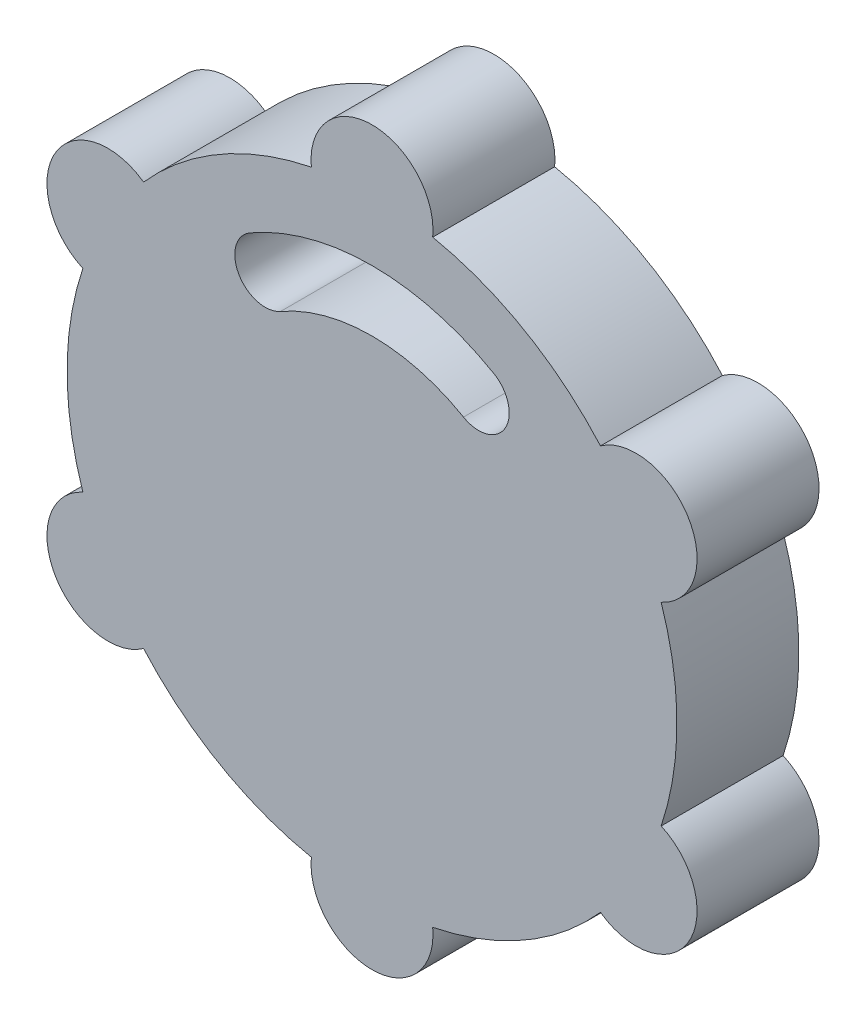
ISO-10303-21;
HEADER;
FILE_DESCRIPTION(('STEP AP214'),'2;1');
FILE_NAME('part.step','',(''),(''),'','','');
FILE_SCHEMA(('AUTOMOTIVE_DESIGN { 1 0 10303 214 1 1 1 1 }'));
ENDSEC;
DATA;
#1=APPLICATION_CONTEXT('core data for automotive mechanical design processes');
#2=APPLICATION_PROTOCOL_DEFINITION('international standard','automotive_design',2000,#1);
#3=PRODUCT_CONTEXT('',#1,'mechanical');
#4=PRODUCT('Part','Part','',(#3));
#5=PRODUCT_RELATED_PRODUCT_CATEGORY('part','',(#4));
#6=PRODUCT_DEFINITION_FORMATION('','',#4);
#7=PRODUCT_DEFINITION_CONTEXT('part definition',#1,'design');
#8=PRODUCT_DEFINITION('design','',#6,#7);
#9=PRODUCT_DEFINITION_SHAPE('','',#8);
#10=(LENGTH_UNIT() NAMED_UNIT(*) SI_UNIT(.MILLI.,.METRE.));
#11=(NAMED_UNIT(*) PLANE_ANGLE_UNIT() SI_UNIT($,.RADIAN.));
#12=(NAMED_UNIT(*) SI_UNIT($,.STERADIAN.) SOLID_ANGLE_UNIT());
#13=UNCERTAINTY_MEASURE_WITH_UNIT(LENGTH_MEASURE(1.E-05),#10,'distance_accuracy_value','');
#14=(GEOMETRIC_REPRESENTATION_CONTEXT(3) GLOBAL_UNCERTAINTY_ASSIGNED_CONTEXT((#13)) GLOBAL_UNIT_ASSIGNED_CONTEXT((#10,
#11,#12)) REPRESENTATION_CONTEXT('',''));
#15=CARTESIAN_POINT('',(0.,0.,0.));
#16=DIRECTION('',(0.,0.,1.));
#17=DIRECTION('',(1.,0.,0.));
#18=AXIS2_PLACEMENT_3D('',#15,#16,#17);
#19=CARTESIAN_POINT('',(43.301270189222,24.9999999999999,20.));
#20=DIRECTION('',(0.,0.,-1.));
#21=DIRECTION('',(-1.,0.,0.));
#22=AXIS2_PLACEMENT_3D('',#19,#20,#21);
#23=CYLINDRICAL_SURFACE('',#22,10.);
#24=CARTESIAN_POINT('',(43.301270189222,24.9999999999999,0.));
#25=DIRECTION('',(0.,0.,1.));
#26=DIRECTION('',(1.,0.,0.));
#27=AXIS2_PLACEMENT_3D('',#24,#25,#26);
#28=CIRCLE('',#27,10.);
#29=CARTESIAN_POINT('',(47.4101819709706,15.8831560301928,0.));
#30=VERTEX_POINT('',#29);
#31=CARTESIAN_POINT('',(37.4603075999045,33.1168439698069,0.));
#32=VERTEX_POINT('',#31);
#33=EDGE_CURVE('E170',#30,#32,#28,.T.);
#34=ORIENTED_EDGE('',*,*,#33,.T.);
#35=DIRECTION('',(0.,0.,-1.));
#36=VECTOR('',#35,1.);
#37=CARTESIAN_POINT('',(37.4603075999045,33.1168439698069,20.));
#38=LINE('',#37,#36);
#39=CARTESIAN_POINT('',(37.4603075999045,33.1168439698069,20.));
#40=VERTEX_POINT('',#39);
#41=EDGE_CURVE('E255',#40,#32,#38,.T.);
#42=ORIENTED_EDGE('',*,*,#41,.F.);
#43=CARTESIAN_POINT('',(43.301270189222,24.9999999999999,20.));
#44=DIRECTION('',(0.,0.,1.));
#45=DIRECTION('',(1.,0.,0.));
#46=AXIS2_PLACEMENT_3D('',#43,#44,#45);
#47=CIRCLE('',#46,10.);
#48=CARTESIAN_POINT('',(47.4101819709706,15.8831560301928,20.));
#49=VERTEX_POINT('',#48);
#50=EDGE_CURVE('E197',#49,#40,#47,.T.);
#51=ORIENTED_EDGE('',*,*,#50,.F.);
#52=DIRECTION('',(0.,0.,-1.));
#53=VECTOR('',#52,1.);
#54=CARTESIAN_POINT('',(47.4101819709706,15.8831560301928,20.));
#55=LINE('',#54,#53);
#56=EDGE_CURVE('E222',#49,#30,#55,.T.);
#57=ORIENTED_EDGE('',*,*,#56,.T.);
#58=EDGE_LOOP('',(#34,#42,#51,#57));
#59=FACE_BOUND('',#58,.T.);
#60=ADVANCED_FACE('F32',(#59),#23,.T.);
#61=CARTESIAN_POINT('',(0.,0.,20.));
#62=DIRECTION('',(0.,0.,-1.));
#63=DIRECTION('',(-1.,0.,0.));
#64=AXIS2_PLACEMENT_3D('',#61,#62,#63);
#65=CYLINDRICAL_SURFACE('',#64,50.);
#66=CARTESIAN_POINT('',(0.,0.,0.));
#67=DIRECTION('',(0.,0.,1.));
#68=DIRECTION('',(1.,0.,0.));
#69=AXIS2_PLACEMENT_3D('',#66,#67,#68);
#70=CIRCLE('',#69,50.);
#71=CARTESIAN_POINT('',(9.94987437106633,49.,0.));
#72=VERTEX_POINT('',#71);
#73=EDGE_CURVE('E175',#32,#72,#70,.T.);
#74=ORIENTED_EDGE('',*,*,#73,.T.);
#75=DIRECTION('',(0.,0.,-1.));
#76=VECTOR('',#75,1.);
#77=CARTESIAN_POINT('',(9.94987437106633,49.,20.));
#78=LINE('',#77,#76);
#79=CARTESIAN_POINT('',(9.94987437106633,49.,20.));
#80=VERTEX_POINT('',#79);
#81=EDGE_CURVE('E252',#80,#72,#78,.T.);
#82=ORIENTED_EDGE('',*,*,#81,.F.);
#83=CARTESIAN_POINT('',(0.,0.,20.));
#84=DIRECTION('',(0.,0.,1.));
#85=DIRECTION('',(1.,0.,0.));
#86=AXIS2_PLACEMENT_3D('',#83,#84,#85);
#87=CIRCLE('',#86,50.);
#88=EDGE_CURVE('E200',#40,#80,#87,.T.);
#89=ORIENTED_EDGE('',*,*,#88,.F.);
#90=ORIENTED_EDGE('',*,*,#41,.T.);
#91=EDGE_LOOP('',(#74,#82,#89,#90));
#92=FACE_BOUND('',#91,.T.);
#93=ADVANCED_FACE('F278',(#92),#65,.T.);
#94=CARTESIAN_POINT('',(1.11022302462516E-13,50.,20.));
#95=DIRECTION('',(0.,0.,-1.));
#96=DIRECTION('',(-1.,0.,0.));
#97=AXIS2_PLACEMENT_3D('',#94,#95,#96);
#98=CYLINDRICAL_SURFACE('',#97,10.);
#99=CARTESIAN_POINT('',(1.11022302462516E-13,50.,0.));
#100=DIRECTION('',(0.,0.,1.));
#101=DIRECTION('',(1.,0.,0.));
#102=AXIS2_PLACEMENT_3D('',#99,#100,#101);
#103=CIRCLE('',#102,10.);
#104=CARTESIAN_POINT('',(-9.9498743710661,49.,0.));
#105=VERTEX_POINT('',#104);
#106=EDGE_CURVE('E177',#72,#105,#103,.T.);
#107=ORIENTED_EDGE('',*,*,#106,.T.);
#108=DIRECTION('',(0.,0.,-1.));
#109=VECTOR('',#108,1.);
#110=CARTESIAN_POINT('',(-9.9498743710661,49.,20.));
#111=LINE('',#110,#109);
#112=CARTESIAN_POINT('',(-9.9498743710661,49.,20.));
#113=VERTEX_POINT('',#112);
#114=EDGE_CURVE('E249',#113,#105,#111,.T.);
#115=ORIENTED_EDGE('',*,*,#114,.F.);
#116=CARTESIAN_POINT('',(1.11022302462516E-13,50.,20.));
#117=DIRECTION('',(0.,0.,1.));
#118=DIRECTION('',(1.,0.,0.));
#119=AXIS2_PLACEMENT_3D('',#116,#117,#118);
#120=CIRCLE('',#119,10.);
#121=EDGE_CURVE('E202',#80,#113,#120,.T.);
#122=ORIENTED_EDGE('',*,*,#121,.F.);
#123=ORIENTED_EDGE('',*,*,#81,.T.);
#124=EDGE_LOOP('',(#107,#115,#122,#123));
#125=FACE_BOUND('',#124,.T.);
#126=ADVANCED_FACE('F283',(#125),#98,.T.);
#127=CARTESIAN_POINT('',(0.,0.,20.));
#128=DIRECTION('',(0.,0.,-1.));
#129=DIRECTION('',(-1.,0.,0.));
#130=AXIS2_PLACEMENT_3D('',#127,#128,#129);
#131=CYLINDRICAL_SURFACE('',#130,50.);
#132=CARTESIAN_POINT('',(0.,0.,0.));
#133=DIRECTION('',(0.,0.,1.));
#134=DIRECTION('',(1.,0.,0.));
#135=AXIS2_PLACEMENT_3D('',#132,#133,#134);
#136=CIRCLE('',#135,50.);
#137=CARTESIAN_POINT('',(-37.4603075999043,33.1168439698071,0.));
#138=VERTEX_POINT('',#137);
#139=EDGE_CURVE('E179',#105,#138,#136,.T.);
#140=ORIENTED_EDGE('',*,*,#139,.T.);
#141=DIRECTION('',(0.,0.,-1.));
#142=VECTOR('',#141,1.);
#143=CARTESIAN_POINT('',(-37.4603075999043,33.1168439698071,20.));
#144=LINE('',#143,#142);
#145=CARTESIAN_POINT('',(-37.4603075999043,33.1168439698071,20.));
#146=VERTEX_POINT('',#145);
#147=EDGE_CURVE('E246',#146,#138,#144,.T.);
#148=ORIENTED_EDGE('',*,*,#147,.F.);
#149=CARTESIAN_POINT('',(0.,0.,20.));
#150=DIRECTION('',(0.,0.,1.));
#151=DIRECTION('',(1.,0.,0.));
#152=AXIS2_PLACEMENT_3D('',#149,#150,#151);
#153=CIRCLE('',#152,50.);
#154=EDGE_CURVE('E204',#113,#146,#153,.T.);
#155=ORIENTED_EDGE('',*,*,#154,.F.);
#156=ORIENTED_EDGE('',*,*,#114,.T.);
#157=EDGE_LOOP('',(#140,#148,#155,#156));
#158=FACE_BOUND('',#157,.T.);
#159=ADVANCED_FACE('F334',(#158),#131,.T.);
#160=CARTESIAN_POINT('',(-43.3012701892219,25.0000000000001,20.));
#161=DIRECTION('',(0.,0.,-1.));
#162=DIRECTION('',(-1.,0.,0.));
#163=AXIS2_PLACEMENT_3D('',#160,#161,#162);
#164=CYLINDRICAL_SURFACE('',#163,10.);
#165=CARTESIAN_POINT('',(-43.3012701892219,25.0000000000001,0.));
#166=DIRECTION('',(0.,0.,1.));
#167=DIRECTION('',(1.,0.,0.));
#168=AXIS2_PLACEMENT_3D('',#165,#166,#167);
#169=CIRCLE('',#168,10.);
#170=CARTESIAN_POINT('',(-47.4101819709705,15.883156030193,0.));
#171=VERTEX_POINT('',#170);
#172=EDGE_CURVE('E181',#138,#171,#169,.T.);
#173=ORIENTED_EDGE('',*,*,#172,.T.);
#174=DIRECTION('',(0.,0.,-1.));
#175=VECTOR('',#174,1.);
#176=CARTESIAN_POINT('',(-47.4101819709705,15.883156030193,20.));
#177=LINE('',#176,#175);
#178=CARTESIAN_POINT('',(-47.4101819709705,15.883156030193,20.));
#179=VERTEX_POINT('',#178);
#180=EDGE_CURVE('E243',#179,#171,#177,.T.);
#181=ORIENTED_EDGE('',*,*,#180,.F.);
#182=CARTESIAN_POINT('',(-43.3012701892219,25.0000000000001,20.));
#183=DIRECTION('',(0.,0.,1.));
#184=DIRECTION('',(1.,0.,0.));
#185=AXIS2_PLACEMENT_3D('',#182,#183,#184);
#186=CIRCLE('',#185,10.);
#187=EDGE_CURVE('E206',#146,#179,#186,.T.);
#188=ORIENTED_EDGE('',*,*,#187,.F.);
#189=ORIENTED_EDGE('',*,*,#147,.T.);
#190=EDGE_LOOP('',(#173,#181,#188,#189));
#191=FACE_BOUND('',#190,.T.);
#192=ADVANCED_FACE('F331',(#191),#164,.T.);
#193=CARTESIAN_POINT('',(0.,0.,20.));
#194=DIRECTION('',(0.,0.,-1.));
#195=DIRECTION('',(-1.,0.,0.));
#196=AXIS2_PLACEMENT_3D('',#193,#194,#195);
#197=CYLINDRICAL_SURFACE('',#196,50.);
#198=CARTESIAN_POINT('',(0.,0.,0.));
#199=DIRECTION('',(0.,0.,1.));
#200=DIRECTION('',(1.,0.,0.));
#201=AXIS2_PLACEMENT_3D('',#198,#199,#200);
#202=CIRCLE('',#201,50.);
#203=CARTESIAN_POINT('',(-47.4101819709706,-15.8831560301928,0.));
#204=VERTEX_POINT('',#203);
#205=EDGE_CURVE('E183',#171,#204,#202,.T.);
#206=ORIENTED_EDGE('',*,*,#205,.T.);
#207=DIRECTION('',(0.,0.,-1.));
#208=VECTOR('',#207,1.);
#209=CARTESIAN_POINT('',(-47.4101819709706,-15.8831560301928,20.));
#210=LINE('',#209,#208);
#211=CARTESIAN_POINT('',(-47.4101819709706,-15.8831560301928,20.));
#212=VERTEX_POINT('',#211);
#213=EDGE_CURVE('E240',#212,#204,#210,.T.);
#214=ORIENTED_EDGE('',*,*,#213,.F.);
#215=CARTESIAN_POINT('',(0.,0.,20.));
#216=DIRECTION('',(0.,0.,1.));
#217=DIRECTION('',(1.,0.,0.));
#218=AXIS2_PLACEMENT_3D('',#215,#216,#217);
#219=CIRCLE('',#218,50.);
#220=EDGE_CURVE('E208',#179,#212,#219,.T.);
#221=ORIENTED_EDGE('',*,*,#220,.F.);
#222=ORIENTED_EDGE('',*,*,#180,.T.);
#223=EDGE_LOOP('',(#206,#214,#221,#222));
#224=FACE_BOUND('',#223,.T.);
#225=ADVANCED_FACE('F327',(#224),#197,.T.);
#226=CARTESIAN_POINT('',(-43.301270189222,-24.9999999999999,20.));
#227=DIRECTION('',(0.,0.,-1.));
#228=DIRECTION('',(-1.,0.,0.));
#229=AXIS2_PLACEMENT_3D('',#226,#227,#228);
#230=CYLINDRICAL_SURFACE('',#229,10.);
#231=CARTESIAN_POINT('',(-43.301270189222,-24.9999999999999,0.));
#232=DIRECTION('',(0.,0.,1.));
#233=DIRECTION('',(1.,0.,0.));
#234=AXIS2_PLACEMENT_3D('',#231,#232,#233);
#235=CIRCLE('',#234,10.);
#236=CARTESIAN_POINT('',(-37.4603075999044,-33.116843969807,0.));
#237=VERTEX_POINT('',#236);
#238=EDGE_CURVE('E185',#204,#237,#235,.T.);
#239=ORIENTED_EDGE('',*,*,#238,.T.);
#240=DIRECTION('',(0.,0.,-1.));
#241=VECTOR('',#240,1.);
#242=CARTESIAN_POINT('',(-37.4603075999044,-33.116843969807,20.));
#243=LINE('',#242,#241);
#244=CARTESIAN_POINT('',(-37.4603075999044,-33.116843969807,20.));
#245=VERTEX_POINT('',#244);
#246=EDGE_CURVE('E237',#245,#237,#243,.T.);
#247=ORIENTED_EDGE('',*,*,#246,.F.);
#248=CARTESIAN_POINT('',(-43.301270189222,-24.9999999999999,20.));
#249=DIRECTION('',(0.,0.,1.));
#250=DIRECTION('',(1.,0.,0.));
#251=AXIS2_PLACEMENT_3D('',#248,#249,#250);
#252=CIRCLE('',#251,10.);
#253=EDGE_CURVE('E210',#212,#245,#252,.T.);
#254=ORIENTED_EDGE('',*,*,#253,.F.);
#255=ORIENTED_EDGE('',*,*,#213,.T.);
#256=EDGE_LOOP('',(#239,#247,#254,#255));
#257=FACE_BOUND('',#256,.T.);
#258=ADVANCED_FACE('F322',(#257),#230,.T.);
#259=CARTESIAN_POINT('',(0.,0.,20.));
#260=DIRECTION('',(0.,0.,-1.));
#261=DIRECTION('',(-1.,0.,0.));
#262=AXIS2_PLACEMENT_3D('',#259,#260,#261);
#263=CYLINDRICAL_SURFACE('',#262,50.);
#264=CARTESIAN_POINT('',(0.,0.,0.));
#265=DIRECTION('',(0.,0.,1.));
#266=DIRECTION('',(1.,0.,0.));
#267=AXIS2_PLACEMENT_3D('',#264,#265,#266);
#268=CIRCLE('',#267,50.);
#269=CARTESIAN_POINT('',(-9.94987437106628,-48.9999999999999,0.));
#270=VERTEX_POINT('',#269);
#271=EDGE_CURVE('E187',#237,#270,#268,.T.);
#272=ORIENTED_EDGE('',*,*,#271,.T.);
#273=DIRECTION('',(0.,0.,-1.));
#274=VECTOR('',#273,1.);
#275=CARTESIAN_POINT('',(-9.94987437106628,-48.9999999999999,20.));
#276=LINE('',#275,#274);
#277=CARTESIAN_POINT('',(-9.94987437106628,-48.9999999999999,20.));
#278=VERTEX_POINT('',#277);
#279=EDGE_CURVE('E234',#278,#270,#276,.T.);
#280=ORIENTED_EDGE('',*,*,#279,.F.);
#281=CARTESIAN_POINT('',(0.,0.,20.));
#282=DIRECTION('',(0.,0.,1.));
#283=DIRECTION('',(1.,0.,0.));
#284=AXIS2_PLACEMENT_3D('',#281,#282,#283);
#285=CIRCLE('',#284,50.);
#286=EDGE_CURVE('E212',#245,#278,#285,.T.);
#287=ORIENTED_EDGE('',*,*,#286,.F.);
#288=ORIENTED_EDGE('',*,*,#246,.T.);
#289=EDGE_LOOP('',(#272,#280,#287,#288));
#290=FACE_BOUND('',#289,.T.);
#291=ADVANCED_FACE('F316',(#290),#263,.T.);
#292=CARTESIAN_POINT('',(-1.07552855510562E-13,-50.,20.));
#293=DIRECTION('',(0.,0.,-1.));
#294=DIRECTION('',(-1.,0.,0.));
#295=AXIS2_PLACEMENT_3D('',#292,#293,#294);
#296=CYLINDRICAL_SURFACE('',#295,10.);
#297=CARTESIAN_POINT('',(-1.07552855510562E-13,-50.,0.));
#298=DIRECTION('',(0.,0.,1.));
#299=DIRECTION('',(1.,0.,0.));
#300=AXIS2_PLACEMENT_3D('',#297,#298,#299);
#301=CIRCLE('',#300,10.);
#302=CARTESIAN_POINT('',(9.94987437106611,-49.,0.));
#303=VERTEX_POINT('',#302);
#304=EDGE_CURVE('E189',#270,#303,#301,.T.);
#305=ORIENTED_EDGE('',*,*,#304,.T.);
#306=DIRECTION('',(0.,0.,-1.));
#307=VECTOR('',#306,1.);
#308=CARTESIAN_POINT('',(9.94987437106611,-49.,20.));
#309=LINE('',#308,#307);
#310=CARTESIAN_POINT('',(9.94987437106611,-49.,20.));
#311=VERTEX_POINT('',#310);
#312=EDGE_CURVE('E231',#311,#303,#309,.T.);
#313=ORIENTED_EDGE('',*,*,#312,.F.);
#314=CARTESIAN_POINT('',(-1.07552855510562E-13,-50.,20.));
#315=DIRECTION('',(0.,0.,1.));
#316=DIRECTION('',(1.,0.,0.));
#317=AXIS2_PLACEMENT_3D('',#314,#315,#316);
#318=CIRCLE('',#317,10.);
#319=EDGE_CURVE('E214',#278,#311,#318,.T.);
#320=ORIENTED_EDGE('',*,*,#319,.F.);
#321=ORIENTED_EDGE('',*,*,#279,.T.);
#322=EDGE_LOOP('',(#305,#313,#320,#321));
#323=FACE_BOUND('',#322,.T.);
#324=ADVANCED_FACE('F312',(#323),#296,.T.);
#325=CARTESIAN_POINT('',(0.,0.,20.));
#326=DIRECTION('',(0.,0.,-1.));
#327=DIRECTION('',(-1.,0.,0.));
#328=AXIS2_PLACEMENT_3D('',#325,#326,#327);
#329=CYLINDRICAL_SURFACE('',#328,50.);
#330=CARTESIAN_POINT('',(0.,0.,0.));
#331=DIRECTION('',(0.,0.,1.));
#332=DIRECTION('',(1.,0.,0.));
#333=AXIS2_PLACEMENT_3D('',#330,#331,#332);
#334=CIRCLE('',#333,50.);
#335=CARTESIAN_POINT('',(37.4603075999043,-33.1168439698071,0.));
#336=VERTEX_POINT('',#335);
#337=EDGE_CURVE('E191',#303,#336,#334,.T.);
#338=ORIENTED_EDGE('',*,*,#337,.T.);
#339=DIRECTION('',(0.,0.,-1.));
#340=VECTOR('',#339,1.);
#341=CARTESIAN_POINT('',(37.4603075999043,-33.1168439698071,20.));
#342=LINE('',#341,#340);
#343=CARTESIAN_POINT('',(37.4603075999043,-33.1168439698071,20.));
#344=VERTEX_POINT('',#343);
#345=EDGE_CURVE('E228',#344,#336,#342,.T.);
#346=ORIENTED_EDGE('',*,*,#345,.F.);
#347=CARTESIAN_POINT('',(0.,0.,20.));
#348=DIRECTION('',(0.,0.,1.));
#349=DIRECTION('',(1.,0.,0.));
#350=AXIS2_PLACEMENT_3D('',#347,#348,#349);
#351=CIRCLE('',#350,50.);
#352=EDGE_CURVE('E216',#311,#344,#351,.T.);
#353=ORIENTED_EDGE('',*,*,#352,.F.);
#354=ORIENTED_EDGE('',*,*,#312,.T.);
#355=EDGE_LOOP('',(#338,#346,#353,#354));
#356=FACE_BOUND('',#355,.T.);
#357=ADVANCED_FACE('F307',(#356),#329,.T.);
#358=CARTESIAN_POINT('',(43.3012701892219,-25.0000000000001,20.));
#359=DIRECTION('',(0.,0.,-1.));
#360=DIRECTION('',(-1.,0.,0.));
#361=AXIS2_PLACEMENT_3D('',#358,#359,#360);
#362=CYLINDRICAL_SURFACE('',#361,10.);
#363=CARTESIAN_POINT('',(43.3012701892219,-25.0000000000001,0.));
#364=DIRECTION('',(0.,0.,1.));
#365=DIRECTION('',(1.,0.,0.));
#366=AXIS2_PLACEMENT_3D('',#363,#364,#365);
#367=CIRCLE('',#366,10.);
#368=CARTESIAN_POINT('',(47.4101819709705,-15.883156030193,0.));
#369=VERTEX_POINT('',#368);
#370=EDGE_CURVE('E193',#336,#369,#367,.T.);
#371=ORIENTED_EDGE('',*,*,#370,.T.);
#372=DIRECTION('',(0.,0.,-1.));
#373=VECTOR('',#372,1.);
#374=CARTESIAN_POINT('',(47.4101819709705,-15.883156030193,20.));
#375=LINE('',#374,#373);
#376=CARTESIAN_POINT('',(47.4101819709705,-15.883156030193,20.));
#377=VERTEX_POINT('',#376);
#378=EDGE_CURVE('E225',#377,#369,#375,.T.);
#379=ORIENTED_EDGE('',*,*,#378,.F.);
#380=CARTESIAN_POINT('',(43.3012701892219,-25.0000000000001,20.));
#381=DIRECTION('',(0.,0.,1.));
#382=DIRECTION('',(1.,0.,0.));
#383=AXIS2_PLACEMENT_3D('',#380,#381,#382);
#384=CIRCLE('',#383,10.);
#385=EDGE_CURVE('E218',#344,#377,#384,.T.);
#386=ORIENTED_EDGE('',*,*,#385,.F.);
#387=ORIENTED_EDGE('',*,*,#345,.T.);
#388=EDGE_LOOP('',(#371,#379,#386,#387));
#389=FACE_BOUND('',#388,.T.);
#390=ADVANCED_FACE('F301',(#389),#362,.T.);
#391=CARTESIAN_POINT('',(0.,0.,20.));
#392=DIRECTION('',(0.,0.,-1.));
#393=DIRECTION('',(-1.,0.,0.));
#394=AXIS2_PLACEMENT_3D('',#391,#392,#393);
#395=CYLINDRICAL_SURFACE('',#394,50.);
#396=CARTESIAN_POINT('',(0.,0.,0.));
#397=DIRECTION('',(0.,0.,1.));
#398=DIRECTION('',(1.,0.,0.));
#399=AXIS2_PLACEMENT_3D('',#396,#397,#398);
#400=CIRCLE('',#399,50.);
#401=EDGE_CURVE('E195',#369,#30,#400,.T.);
#402=ORIENTED_EDGE('',*,*,#401,.T.);
#403=ORIENTED_EDGE('',*,*,#56,.F.);
#404=CARTESIAN_POINT('',(0.,0.,20.));
#405=DIRECTION('',(0.,0.,1.));
#406=DIRECTION('',(1.,0.,0.));
#407=AXIS2_PLACEMENT_3D('',#404,#405,#406);
#408=CIRCLE('',#407,50.);
#409=EDGE_CURVE('E220',#377,#49,#408,.T.);
#410=ORIENTED_EDGE('',*,*,#409,.F.);
#411=ORIENTED_EDGE('',*,*,#378,.T.);
#412=EDGE_LOOP('',(#402,#403,#410,#411));
#413=FACE_BOUND('',#412,.T.);
#414=ADVANCED_FACE('F299',(#413),#395,.T.);
#415=CARTESIAN_POINT('',(21.650635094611,12.4999999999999,20.));
#416=DIRECTION('',(0.,0.,1.));
#417=DIRECTION('',(1.,0.,0.));
#418=AXIS2_PLACEMENT_3D('',#415,#416,#417);
#419=PLANE('',#418);
#420=CARTESIAN_POINT('',(0.,0.,20.));
#421=DIRECTION('',(0.,0.,1.));
#422=DIRECTION('',(1.,0.,0.));
#423=AXIS2_PLACEMENT_3D('',#420,#421,#422);
#424=CIRCLE('',#423,40.);
#425=CARTESIAN_POINT('',(20.,34.6410161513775,20.));
#426=VERTEX_POINT('',#425);
#427=CARTESIAN_POINT('',(-20.,34.6410161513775,20.));
#428=VERTEX_POINT('',#427);
#429=EDGE_CURVE('E46',#426,#428,#424,.T.);
#430=ORIENTED_EDGE('',*,*,#429,.F.);
#431=CARTESIAN_POINT('',(17.5,30.3108891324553,20.));
#432=DIRECTION('',(0.,0.,1.));
#433=DIRECTION('',(1.,0.,0.));
#434=AXIS2_PLACEMENT_3D('',#431,#432,#433);
#435=CIRCLE('',#434,4.99999999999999);
#436=CARTESIAN_POINT('',(15.,25.9807621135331,20.));
#437=VERTEX_POINT('',#436);
#438=EDGE_CURVE('E163',#437,#426,#435,.T.);
#439=ORIENTED_EDGE('',*,*,#438,.F.);
#440=CARTESIAN_POINT('',(0.,0.,20.));
#441=DIRECTION('',(0.,0.,-1.));
#442=DIRECTION('',(1.,0.,0.));
#443=AXIS2_PLACEMENT_3D('',#440,#441,#442);
#444=CIRCLE('',#443,30.);
#445=CARTESIAN_POINT('',(-15.,25.9807621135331,20.));
#446=VERTEX_POINT('',#445);
#447=EDGE_CURVE('E147',#446,#437,#444,.T.);
#448=ORIENTED_EDGE('',*,*,#447,.F.);
#449=CARTESIAN_POINT('',(-17.5,30.3108891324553,20.));
#450=DIRECTION('',(0.,0.,1.));
#451=DIRECTION('',(1.,0.,0.));
#452=AXIS2_PLACEMENT_3D('',#449,#450,#451);
#453=CIRCLE('',#452,5.);
#454=EDGE_CURVE('E156',#428,#446,#453,.T.);
#455=ORIENTED_EDGE('',*,*,#454,.F.);
#456=EDGE_LOOP('',(#430,#439,#448,#455));
#457=FACE_BOUND('',#456,.T.);
#458=ORIENTED_EDGE('',*,*,#50,.T.);
#459=ORIENTED_EDGE('',*,*,#88,.T.);
#460=ORIENTED_EDGE('',*,*,#121,.T.);
#461=ORIENTED_EDGE('',*,*,#154,.T.);
#462=ORIENTED_EDGE('',*,*,#187,.T.);
#463=ORIENTED_EDGE('',*,*,#220,.T.);
#464=ORIENTED_EDGE('',*,*,#253,.T.);
#465=ORIENTED_EDGE('',*,*,#286,.T.);
#466=ORIENTED_EDGE('',*,*,#319,.T.);
#467=ORIENTED_EDGE('',*,*,#352,.T.);
#468=ORIENTED_EDGE('',*,*,#385,.T.);
#469=ORIENTED_EDGE('',*,*,#409,.T.);
#470=EDGE_LOOP('',(#458,#459,#460,#461,#462,#463,#464,#465,#466,#467,#468,#469));
#471=FACE_BOUND('',#470,.T.);
#472=ADVANCED_FACE('F160',(#457,#471),#419,.T.);
#473=CARTESIAN_POINT('',(21.650635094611,12.4999999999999,0.));
#474=DIRECTION('',(0.,0.,1.));
#475=DIRECTION('',(1.,0.,0.));
#476=AXIS2_PLACEMENT_3D('',#473,#474,#475);
#477=PLANE('',#476);
#478=CARTESIAN_POINT('',(17.5,30.3108891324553,0.));
#479=DIRECTION('',(0.,0.,1.));
#480=DIRECTION('',(1.,0.,0.));
#481=AXIS2_PLACEMENT_3D('',#478,#479,#480);
#482=CIRCLE('',#481,4.99999999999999);
#483=CARTESIAN_POINT('',(15.,25.9807621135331,0.));
#484=VERTEX_POINT('',#483);
#485=CARTESIAN_POINT('',(20.,34.6410161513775,0.));
#486=VERTEX_POINT('',#485);
#487=EDGE_CURVE('E39',#484,#486,#482,.T.);
#488=ORIENTED_EDGE('',*,*,#487,.T.);
#489=CARTESIAN_POINT('',(0.,0.,0.));
#490=DIRECTION('',(0.,0.,1.));
#491=DIRECTION('',(1.,0.,0.));
#492=AXIS2_PLACEMENT_3D('',#489,#490,#491);
#493=CIRCLE('',#492,40.);
#494=CARTESIAN_POINT('',(-20.,34.6410161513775,0.));
#495=VERTEX_POINT('',#494);
#496=EDGE_CURVE('E11',#486,#495,#493,.T.);
#497=ORIENTED_EDGE('',*,*,#496,.T.);
#498=CARTESIAN_POINT('',(-17.5,30.3108891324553,0.));
#499=DIRECTION('',(0.,0.,1.));
#500=DIRECTION('',(1.,0.,0.));
#501=AXIS2_PLACEMENT_3D('',#498,#499,#500);
#502=CIRCLE('',#501,5.);
#503=CARTESIAN_POINT('',(-15.,25.9807621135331,0.));
#504=VERTEX_POINT('',#503);
#505=EDGE_CURVE('E258',#495,#504,#502,.T.);
#506=ORIENTED_EDGE('',*,*,#505,.T.);
#507=CARTESIAN_POINT('',(0.,0.,0.));
#508=DIRECTION('',(0.,0.,1.));
#509=DIRECTION('',(1.,0.,0.));
#510=AXIS2_PLACEMENT_3D('',#507,#508,#509);
#511=CIRCLE('',#510,30.);
#512=EDGE_CURVE('E150',#504,#484,#511,.F.);
#513=ORIENTED_EDGE('',*,*,#512,.T.);
#514=EDGE_LOOP('',(#488,#497,#506,#513));
#515=FACE_BOUND('',#514,.T.);
#516=ORIENTED_EDGE('',*,*,#33,.F.);
#517=ORIENTED_EDGE('',*,*,#401,.F.);
#518=ORIENTED_EDGE('',*,*,#370,.F.);
#519=ORIENTED_EDGE('',*,*,#337,.F.);
#520=ORIENTED_EDGE('',*,*,#304,.F.);
#521=ORIENTED_EDGE('',*,*,#271,.F.);
#522=ORIENTED_EDGE('',*,*,#238,.F.);
#523=ORIENTED_EDGE('',*,*,#205,.F.);
#524=ORIENTED_EDGE('',*,*,#172,.F.);
#525=ORIENTED_EDGE('',*,*,#139,.F.);
#526=ORIENTED_EDGE('',*,*,#106,.F.);
#527=ORIENTED_EDGE('',*,*,#73,.F.);
#528=EDGE_LOOP('',(#516,#517,#518,#519,#520,#521,#522,#523,#524,#525,#526,#527));
#529=FACE_BOUND('',#528,.T.);
#530=ADVANCED_FACE('F262',(#515,#529),#477,.F.);
#531=CARTESIAN_POINT('',(0.,0.,-15.));
#532=DIRECTION('',(0.,0.,1.));
#533=DIRECTION('',(1.,0.,0.));
#534=AXIS2_PLACEMENT_3D('',#531,#532,#533);
#535=CYLINDRICAL_SURFACE('',#534,40.);
#536=DIRECTION('',(0.,0.,1.));
#537=VECTOR('',#536,1.);
#538=CARTESIAN_POINT('',(20.,34.6410161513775,-15.));
#539=LINE('',#538,#537);
#540=EDGE_CURVE('E168',#486,#426,#539,.T.);
#541=ORIENTED_EDGE('',*,*,#540,.T.);
#542=ORIENTED_EDGE('',*,*,#429,.T.);
#543=DIRECTION('',(0.,0.,1.));
#544=VECTOR('',#543,1.);
#545=CARTESIAN_POINT('',(-20.,34.6410161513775,-15.));
#546=LINE('',#545,#544);
#547=EDGE_CURVE('E153',#495,#428,#546,.T.);
#548=ORIENTED_EDGE('',*,*,#547,.F.);
#549=ORIENTED_EDGE('',*,*,#496,.F.);
#550=EDGE_LOOP('',(#541,#542,#548,#549));
#551=FACE_BOUND('',#550,.T.);
#552=ADVANCED_FACE('F267',(#551),#535,.F.);
#553=CARTESIAN_POINT('',(17.5,30.3108891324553,-15.));
#554=DIRECTION('',(0.,0.,1.));
#555=DIRECTION('',(1.,0.,0.));
#556=AXIS2_PLACEMENT_3D('',#553,#554,#555);
#557=CYLINDRICAL_SURFACE('',#556,4.99999999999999);
#558=DIRECTION('',(0.,0.,1.));
#559=VECTOR('',#558,1.);
#560=CARTESIAN_POINT('',(15.,25.9807621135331,-15.));
#561=LINE('',#560,#559);
#562=EDGE_CURVE('E152',#484,#437,#561,.T.);
#563=ORIENTED_EDGE('',*,*,#562,.T.);
#564=ORIENTED_EDGE('',*,*,#438,.T.);
#565=ORIENTED_EDGE('',*,*,#540,.F.);
#566=ORIENTED_EDGE('',*,*,#487,.F.);
#567=EDGE_LOOP('',(#563,#564,#565,#566));
#568=FACE_BOUND('',#567,.T.);
#569=ADVANCED_FACE('F266',(#568),#557,.F.);
#570=CARTESIAN_POINT('',(0.,0.,-15.));
#571=DIRECTION('',(0.,0.,1.));
#572=DIRECTION('',(1.,0.,0.));
#573=AXIS2_PLACEMENT_3D('',#570,#571,#572);
#574=CYLINDRICAL_SURFACE('',#573,30.);
#575=DIRECTION('',(0.,0.,1.));
#576=VECTOR('',#575,1.);
#577=CARTESIAN_POINT('',(-15.,25.9807621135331,-15.));
#578=LINE('',#577,#576);
#579=EDGE_CURVE('E54',#504,#446,#578,.T.);
#580=ORIENTED_EDGE('',*,*,#579,.T.);
#581=ORIENTED_EDGE('',*,*,#447,.T.);
#582=ORIENTED_EDGE('',*,*,#562,.F.);
#583=ORIENTED_EDGE('',*,*,#512,.F.);
#584=EDGE_LOOP('',(#580,#581,#582,#583));
#585=FACE_BOUND('',#584,.T.);
#586=ADVANCED_FACE('F144',(#585),#574,.T.);
#587=CARTESIAN_POINT('',(-17.5,30.3108891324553,-15.));
#588=DIRECTION('',(0.,0.,1.));
#589=DIRECTION('',(1.,0.,0.));
#590=AXIS2_PLACEMENT_3D('',#587,#588,#589);
#591=CYLINDRICAL_SURFACE('',#590,5.);
#592=ORIENTED_EDGE('',*,*,#547,.T.);
#593=ORIENTED_EDGE('',*,*,#454,.T.);
#594=ORIENTED_EDGE('',*,*,#579,.F.);
#595=ORIENTED_EDGE('',*,*,#505,.F.);
#596=EDGE_LOOP('',(#592,#593,#594,#595));
#597=FACE_BOUND('',#596,.T.);
#598=ADVANCED_FACE('F157',(#597),#591,.F.);
#599=CLOSED_SHELL('',(#60,#93,#126,#159,#192,#225,#258,#291,#324,#357,#390,#414,#472,#530,#552,
#569,#586,#598));
#600=MANIFOLD_SOLID_BREP('B2',#599);
#601=ADVANCED_BREP_SHAPE_REPRESENTATION('',(#18,#600),#14);
#602=SHAPE_DEFINITION_REPRESENTATION(#9,#601);
ENDSEC;
END-ISO-10303-21;
